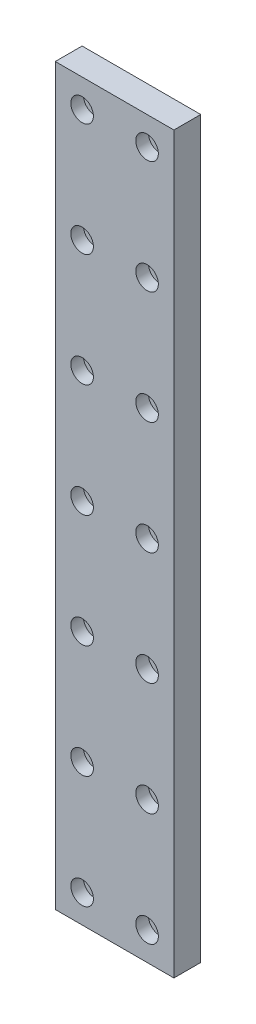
from build123d import *

# Parameters (mm, degrees)
SKETCH_1_W          = 42
SKETCH_1_H          = 260
EXTRUDE_1_DEPTH     = 9.5
SKETCH_2_R          = 2.25
CUT_EXTRUDE_1_DEPTH = 133.027459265
SKETCH_3_R          = 4
CUT_EXTRUDE_2_DEPTH = 4.5


with BuildPart() as part:
    # Sketch 1 → Extrude 1 (new body)
    with BuildSketch(Plane.XY):
        Rectangle(SKETCH_1_W, SKETCH_1_H)
    extrude(amount=EXTRUDE_1_DEPTH)

    # Sketch 2 → Cut-Extrude 1 (cut, through all)
    with BuildSketch(Plane.XY.offset(9.5)):
        with Locations((-11.5, 120)):
            Circle(SKETCH_2_R)
        with Locations(Location((11.5, 120, 0), (0, 0, 180))):
            Circle(SKETCH_2_R)
        with Locations((-11.5, 80)):
            Circle(SKETCH_2_R)
        with Locations(Location((11.5, 80, 0), (0, 0, 180))):
            Circle(SKETCH_2_R)
        with Locations((-11.5, 40)):
            Circle(SKETCH_2_R)
        with Locations(Location((11.5, 40, 0), (0, 0, 180))):
            Circle(SKETCH_2_R)
        with Locations((-11.5, 0)):
            Circle(SKETCH_2_R)
        with Locations(Location((11.5, 0, 0), (0, 0, 180))):
            Circle(SKETCH_2_R)
        with Locations((-11.5, -40)):
            Circle(SKETCH_2_R)
        with Locations(Location((11.5, -40, 0), (0, 0, 180))):
            Circle(SKETCH_2_R)
        with Locations((-11.5, -80)):
            Circle(SKETCH_2_R)
        with Locations(Location((11.5, -80, 0), (0, 0, 180))):
            Circle(SKETCH_2_R)
        with Locations((-11.5, -120)):
            Circle(SKETCH_2_R)
        with Locations(Location((11.5, -120, 0), (0, 0, 180))):
            Circle(SKETCH_2_R)
    extrude(amount=-CUT_EXTRUDE_1_DEPTH, mode=Mode.SUBTRACT)

    # Sketch 3 → Cut-Extrude 2 (cut)
    with BuildSketch(Plane.XY.offset(9.5)):
        with Locations((-11.5, 120)):
            Circle(SKETCH_3_R)
        with Locations(Location((11.5, 120, 0), (0, 0, 180))):
            Circle(SKETCH_3_R)
        with Locations((-11.5, 80)):
            Circle(SKETCH_3_R)
        with Locations(Location((11.5, 80, 0), (0, 0, 180))):
            Circle(SKETCH_3_R)
        with Locations((-11.5, 40)):
            Circle(SKETCH_3_R)
        with Locations(Location((11.5, 40, 0), (0, 0, 180))):
            Circle(SKETCH_3_R)
        with Locations((-11.5, 0)):
            Circle(SKETCH_3_R)
        with Locations(Location((11.5, 0, 0), (0, 0, 180))):
            Circle(SKETCH_3_R)
        with Locations((-11.5, -40)):
            Circle(SKETCH_3_R)
        with Locations(Location((11.5, -40, 0), (0, 0, 180))):
            Circle(SKETCH_3_R)
        with Locations((-11.5, -80)):
            Circle(SKETCH_3_R)
        with Locations(Location((11.5, -80, 0), (0, 0, 180))):
            Circle(SKETCH_3_R)
        with Locations((-11.5, -120)):
            Circle(SKETCH_3_R)
        with Locations(Location((11.5, -120, 0), (0, 0, 180))):
            Circle(SKETCH_3_R)
    extrude(amount=-CUT_EXTRUDE_2_DEPTH, mode=Mode.SUBTRACT)


solid = part.part
